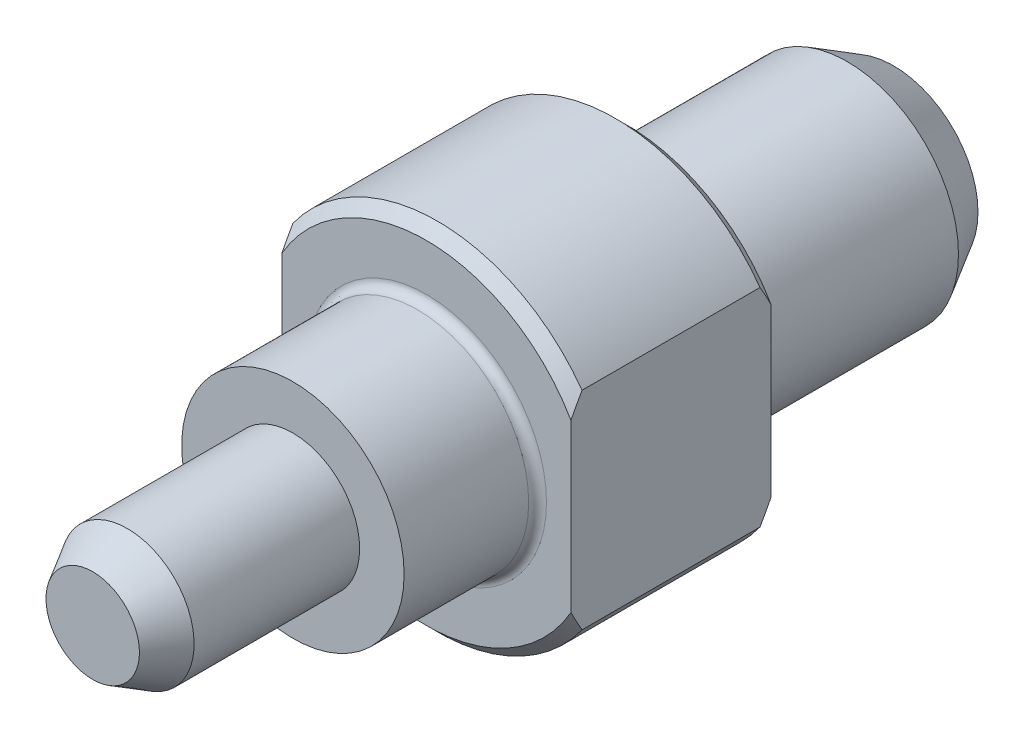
ISO-10303-21;
HEADER;
FILE_DESCRIPTION(('STEP AP214'),'2;1');
FILE_NAME('part.step','',(''),(''),'','','');
FILE_SCHEMA(('AUTOMOTIVE_DESIGN { 1 0 10303 214 1 1 1 1 }'));
ENDSEC;
DATA;
#1=APPLICATION_CONTEXT('core data for automotive mechanical design processes');
#2=APPLICATION_PROTOCOL_DEFINITION('international standard','automotive_design',2000,#1);
#3=PRODUCT_CONTEXT('',#1,'mechanical');
#4=PRODUCT('Part','Part','',(#3));
#5=PRODUCT_RELATED_PRODUCT_CATEGORY('part','',(#4));
#6=PRODUCT_DEFINITION_FORMATION('','',#4);
#7=PRODUCT_DEFINITION_CONTEXT('part definition',#1,'design');
#8=PRODUCT_DEFINITION('design','',#6,#7);
#9=PRODUCT_DEFINITION_SHAPE('','',#8);
#10=(LENGTH_UNIT() NAMED_UNIT(*) SI_UNIT(.MILLI.,.METRE.));
#11=(NAMED_UNIT(*) PLANE_ANGLE_UNIT() SI_UNIT($,.RADIAN.));
#12=(NAMED_UNIT(*) SI_UNIT($,.STERADIAN.) SOLID_ANGLE_UNIT());
#13=UNCERTAINTY_MEASURE_WITH_UNIT(LENGTH_MEASURE(1.E-05),#10,'distance_accuracy_value','');
#14=(GEOMETRIC_REPRESENTATION_CONTEXT(3) GLOBAL_UNCERTAINTY_ASSIGNED_CONTEXT((#13)) GLOBAL_UNIT_ASSIGNED_CONTEXT((#10,
#11,#12)) REPRESENTATION_CONTEXT('',''));
#15=CARTESIAN_POINT('',(0.,0.,0.));
#16=DIRECTION('',(0.,0.,1.));
#17=DIRECTION('',(1.,0.,0.));
#18=AXIS2_PLACEMENT_3D('',#15,#16,#17);
#19=CARTESIAN_POINT('',(0.,0.,24.));
#20=DIRECTION('',(0.,0.,-1.));
#21=DIRECTION('',(-1.,0.,0.));
#22=AXIS2_PLACEMENT_3D('',#19,#20,#21);
#23=CYLINDRICAL_SURFACE('',#22,3.);
#24=CARTESIAN_POINT('',(0.,0.,15.));
#25=DIRECTION('',(0.,0.,1.));
#26=DIRECTION('',(1.,0.,0.));
#27=AXIS2_PLACEMENT_3D('',#24,#25,#26);
#28=CIRCLE('',#27,3.);
#29=CARTESIAN_POINT('',(3.,0.,15.));
#30=VERTEX_POINT('',#29);
#31=EDGE_CURVE('E111',#30,#30,#28,.T.);
#32=ORIENTED_EDGE('',*,*,#31,.T.);
#33=EDGE_LOOP('',(#32));
#34=FACE_BOUND('',#33,.T.);
#35=CARTESIAN_POINT('',(0.,0.,22.441154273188));
#36=DIRECTION('',(0.,0.,-1.));
#37=DIRECTION('',(-1.,0.,0.));
#38=AXIS2_PLACEMENT_3D('',#35,#36,#37);
#39=CIRCLE('',#38,3.);
#40=CARTESIAN_POINT('',(-3.,0.,22.441154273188));
#41=VERTEX_POINT('',#40);
#42=EDGE_CURVE('E260',#41,#41,#39,.F.);
#43=ORIENTED_EDGE('',*,*,#42,.F.);
#44=EDGE_LOOP('',(#43));
#45=FACE_BOUND('',#44,.T.);
#46=ADVANCED_FACE('F14',(#34,#45),#23,.T.);
#47=CARTESIAN_POINT('',(0.,0.,0.));
#48=DIRECTION('',(0.,0.,-1.));
#49=DIRECTION('',(-1.,0.,0.));
#50=AXIS2_PLACEMENT_3D('',#47,#48,#49);
#51=CYLINDRICAL_SURFACE('',#50,5.);
#52=CARTESIAN_POINT('',(0.,0.,-0.4));
#53=DIRECTION('',(0.,0.,1.));
#54=DIRECTION('',(1.,0.,0.));
#55=AXIS2_PLACEMENT_3D('',#52,#53,#54);
#56=CIRCLE('',#55,5.);
#57=CARTESIAN_POINT('',(5.,0.,-0.4));
#58=VERTEX_POINT('',#57);
#59=EDGE_CURVE('E194',#58,#58,#56,.F.);
#60=ORIENTED_EDGE('',*,*,#59,.T.);
#61=EDGE_LOOP('',(#60));
#62=FACE_BOUND('',#61,.T.);
#63=CARTESIAN_POINT('',(0.,0.,-9.92153903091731));
#64=DIRECTION('',(0.,0.,1.));
#65=DIRECTION('',(1.,0.,0.));
#66=AXIS2_PLACEMENT_3D('',#63,#64,#65);
#67=CIRCLE('',#66,5.);
#68=CARTESIAN_POINT('',(5.,0.,-9.92153903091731));
#69=VERTEX_POINT('',#68);
#70=EDGE_CURVE('E255',#69,#69,#67,.T.);
#71=ORIENTED_EDGE('',*,*,#70,.T.);
#72=EDGE_LOOP('',(#71));
#73=FACE_BOUND('',#72,.T.);
#74=ADVANCED_FACE('F216',(#62,#73),#51,.T.);
#75=CARTESIAN_POINT('',(0.,0.,0.));
#76=DIRECTION('',(0.,0.,1.));
#77=DIRECTION('',(1.,0.,0.));
#78=AXIS2_PLACEMENT_3D('',#75,#76,#77);
#79=PLANE('',#78);
#80=CARTESIAN_POINT('',(0.,0.,0.));
#81=DIRECTION('',(0.,0.,1.));
#82=DIRECTION('',(1.,0.,0.));
#83=AXIS2_PLACEMENT_3D('',#80,#81,#82);
#84=CIRCLE('',#83,5.4);
#85=CARTESIAN_POINT('',(5.4,0.,0.));
#86=VERTEX_POINT('',#85);
#87=EDGE_CURVE('E191',#86,#86,#84,.T.);
#88=ORIENTED_EDGE('',*,*,#87,.T.);
#89=EDGE_LOOP('',(#88));
#90=FACE_BOUND('',#89,.T.);
#91=DIRECTION('',(0.,-1.,0.));
#92=VECTOR('',#91,1.);
#93=CARTESIAN_POINT('',(6.5,0.,0.));
#94=LINE('',#93,#92);
#95=CARTESIAN_POINT('',(6.5,3.74165738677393,0.));
#96=VERTEX_POINT('',#95);
#97=CARTESIAN_POINT('',(6.5,-3.74165738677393,0.));
#98=VERTEX_POINT('',#97);
#99=EDGE_CURVE('E274',#96,#98,#94,.T.);
#100=ORIENTED_EDGE('',*,*,#99,.T.);
#101=CARTESIAN_POINT('',(0.,0.,0.));
#102=DIRECTION('',(0.,0.,1.));
#103=DIRECTION('',(1.,0.,0.));
#104=AXIS2_PLACEMENT_3D('',#101,#102,#103);
#105=CIRCLE('',#104,7.5);
#106=CARTESIAN_POINT('',(-6.5,-3.74165738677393,0.));
#107=VERTEX_POINT('',#106);
#108=EDGE_CURVE('E284',#98,#107,#105,.F.);
#109=ORIENTED_EDGE('',*,*,#108,.T.);
#110=DIRECTION('',(0.,-1.,0.));
#111=VECTOR('',#110,1.);
#112=CARTESIAN_POINT('',(-6.5,0.,0.));
#113=LINE('',#112,#111);
#114=CARTESIAN_POINT('',(-6.5,3.74165738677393,0.));
#115=VERTEX_POINT('',#114);
#116=EDGE_CURVE('E87',#115,#107,#113,.T.);
#117=ORIENTED_EDGE('',*,*,#116,.F.);
#118=CARTESIAN_POINT('',(0.,0.,0.));
#119=DIRECTION('',(0.,0.,1.));
#120=DIRECTION('',(1.,0.,0.));
#121=AXIS2_PLACEMENT_3D('',#118,#119,#120);
#122=CIRCLE('',#121,7.5);
#123=EDGE_CURVE('E285',#115,#96,#122,.F.);
#124=ORIENTED_EDGE('',*,*,#123,.T.);
#125=EDGE_LOOP('',(#100,#109,#117,#124));
#126=FACE_BOUND('',#125,.T.);
#127=ADVANCED_FACE('F222',(#90,#126),#79,.F.);
#128=CARTESIAN_POINT('',(0.,0.,9.));
#129=DIRECTION('',(0.,0.,-1.));
#130=DIRECTION('',(-1.,0.,0.));
#131=AXIS2_PLACEMENT_3D('',#128,#129,#130);
#132=CYLINDRICAL_SURFACE('',#131,8.);
#133=DIRECTION('',(0.,0.,1.));
#134=VECTOR('',#133,1.);
#135=CARTESIAN_POINT('',(6.5,4.66368952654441,-12.));
#136=LINE('',#135,#134);
#137=CARTESIAN_POINT('',(6.5,4.66368952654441,0.5));
#138=VERTEX_POINT('',#137);
#139=CARTESIAN_POINT('',(6.5,4.66368952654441,8.5));
#140=VERTEX_POINT('',#139);
#141=EDGE_CURVE('E269',#138,#140,#136,.T.);
#142=ORIENTED_EDGE('',*,*,#141,.F.);
#143=CARTESIAN_POINT('',(0.,0.,0.5));
#144=DIRECTION('',(0.,0.,1.));
#145=DIRECTION('',(1.,0.,0.));
#146=AXIS2_PLACEMENT_3D('',#143,#144,#145);
#147=CIRCLE('',#146,8.);
#148=CARTESIAN_POINT('',(-6.5,4.66368952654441,0.5));
#149=VERTEX_POINT('',#148);
#150=EDGE_CURVE('E189',#138,#149,#147,.T.);
#151=ORIENTED_EDGE('',*,*,#150,.T.);
#152=DIRECTION('',(0.,0.,1.));
#153=VECTOR('',#152,1.);
#154=CARTESIAN_POINT('',(-6.5,4.66368952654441,-12.));
#155=LINE('',#154,#153);
#156=CARTESIAN_POINT('',(-6.5,4.66368952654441,8.5));
#157=VERTEX_POINT('',#156);
#158=EDGE_CURVE('E102',#149,#157,#155,.T.);
#159=ORIENTED_EDGE('',*,*,#158,.T.);
#160=CARTESIAN_POINT('',(0.,0.,8.5));
#161=DIRECTION('',(0.,0.,1.));
#162=DIRECTION('',(1.,0.,0.));
#163=AXIS2_PLACEMENT_3D('',#160,#161,#162);
#164=CIRCLE('',#163,8.);
#165=EDGE_CURVE('E187',#157,#140,#164,.F.);
#166=ORIENTED_EDGE('',*,*,#165,.T.);
#167=EDGE_LOOP('',(#142,#151,#159,#166));
#168=FACE_BOUND('',#167,.T.);
#169=ADVANCED_FACE('F235',(#168),#132,.T.);
#170=DIRECTION('',(0.,0.,1.));
#171=VECTOR('',#170,1.);
#172=CARTESIAN_POINT('',(-6.5,-4.6636895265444,-12.));
#173=LINE('',#172,#171);
#174=CARTESIAN_POINT('',(-6.5,-4.6636895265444,0.5));
#175=VERTEX_POINT('',#174);
#176=CARTESIAN_POINT('',(-6.5,-4.6636895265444,8.5));
#177=VERTEX_POINT('',#176);
#178=EDGE_CURVE('E84',#175,#177,#173,.T.);
#179=ORIENTED_EDGE('',*,*,#178,.F.);
#180=CARTESIAN_POINT('',(0.,0.,0.5));
#181=DIRECTION('',(0.,0.,1.));
#182=DIRECTION('',(1.,0.,0.));
#183=AXIS2_PLACEMENT_3D('',#180,#181,#182);
#184=CIRCLE('',#183,8.);
#185=CARTESIAN_POINT('',(6.5,-4.66368952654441,0.5));
#186=VERTEX_POINT('',#185);
#187=EDGE_CURVE('E98',#175,#186,#184,.T.);
#188=ORIENTED_EDGE('',*,*,#187,.T.);
#189=DIRECTION('',(0.,0.,1.));
#190=VECTOR('',#189,1.);
#191=CARTESIAN_POINT('',(6.5,-4.66368952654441,-12.));
#192=LINE('',#191,#190);
#193=CARTESIAN_POINT('',(6.5,-4.66368952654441,8.5));
#194=VERTEX_POINT('',#193);
#195=EDGE_CURVE('E272',#186,#194,#192,.T.);
#196=ORIENTED_EDGE('',*,*,#195,.T.);
#197=CARTESIAN_POINT('',(0.,0.,8.5));
#198=DIRECTION('',(0.,0.,1.));
#199=DIRECTION('',(1.,0.,0.));
#200=AXIS2_PLACEMENT_3D('',#197,#198,#199);
#201=CIRCLE('',#200,8.);
#202=EDGE_CURVE('E101',#194,#177,#201,.F.);
#203=ORIENTED_EDGE('',*,*,#202,.T.);
#204=EDGE_LOOP('',(#179,#188,#196,#203));
#205=FACE_BOUND('',#204,.T.);
#206=ADVANCED_FACE('F96',(#205),#132,.T.);
#207=CARTESIAN_POINT('',(0.,0.,9.));
#208=DIRECTION('',(0.,0.,1.));
#209=DIRECTION('',(1.,0.,0.));
#210=AXIS2_PLACEMENT_3D('',#207,#208,#209);
#211=PLANE('',#210);
#212=CARTESIAN_POINT('',(0.,0.,9.));
#213=DIRECTION('',(0.,0.,1.));
#214=DIRECTION('',(1.,0.,0.));
#215=AXIS2_PLACEMENT_3D('',#212,#213,#214);
#216=CIRCLE('',#215,5.4);
#217=CARTESIAN_POINT('',(5.4,0.,9.));
#218=VERTEX_POINT('',#217);
#219=EDGE_CURVE('E9',#218,#218,#216,.F.);
#220=ORIENTED_EDGE('',*,*,#219,.T.);
#221=EDGE_LOOP('',(#220));
#222=FACE_BOUND('',#221,.T.);
#223=DIRECTION('',(0.,-1.,0.));
#224=VECTOR('',#223,1.);
#225=CARTESIAN_POINT('',(-6.5,4.66368952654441,9.));
#226=LINE('',#225,#224);
#227=CARTESIAN_POINT('',(-6.5,3.74165738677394,9.));
#228=VERTEX_POINT('',#227);
#229=CARTESIAN_POINT('',(-6.5,-3.74165738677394,9.));
#230=VERTEX_POINT('',#229);
#231=EDGE_CURVE('E103',#228,#230,#226,.T.);
#232=ORIENTED_EDGE('',*,*,#231,.T.);
#233=CARTESIAN_POINT('',(0.,0.,9.));
#234=DIRECTION('',(0.,0.,1.));
#235=DIRECTION('',(1.,0.,0.));
#236=AXIS2_PLACEMENT_3D('',#233,#234,#235);
#237=CIRCLE('',#236,7.5);
#238=CARTESIAN_POINT('',(6.5,-3.74165738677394,9.));
#239=VERTEX_POINT('',#238);
#240=EDGE_CURVE('E184',#230,#239,#237,.T.);
#241=ORIENTED_EDGE('',*,*,#240,.T.);
#242=DIRECTION('',(0.,-1.,0.));
#243=VECTOR('',#242,1.);
#244=CARTESIAN_POINT('',(6.5,4.66368952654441,9.));
#245=LINE('',#244,#243);
#246=CARTESIAN_POINT('',(6.5,3.74165738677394,9.));
#247=VERTEX_POINT('',#246);
#248=EDGE_CURVE('E266',#247,#239,#245,.T.);
#249=ORIENTED_EDGE('',*,*,#248,.F.);
#250=CARTESIAN_POINT('',(0.,0.,9.));
#251=DIRECTION('',(0.,0.,1.));
#252=DIRECTION('',(1.,0.,0.));
#253=AXIS2_PLACEMENT_3D('',#250,#251,#252);
#254=CIRCLE('',#253,7.5);
#255=EDGE_CURVE('E91',#247,#228,#254,.T.);
#256=ORIENTED_EDGE('',*,*,#255,.T.);
#257=EDGE_LOOP('',(#232,#241,#249,#256));
#258=FACE_BOUND('',#257,.T.);
#259=ADVANCED_FACE('F230',(#222,#258),#211,.T.);
#260=CARTESIAN_POINT('',(0.,0.,15.));
#261=DIRECTION('',(0.,0.,-1.));
#262=DIRECTION('',(-1.,0.,0.));
#263=AXIS2_PLACEMENT_3D('',#260,#261,#262);
#264=CYLINDRICAL_SURFACE('',#263,5.);
#265=CARTESIAN_POINT('',(0.,0.,9.4));
#266=DIRECTION('',(0.,0.,1.));
#267=DIRECTION('',(1.,0.,0.));
#268=AXIS2_PLACEMENT_3D('',#265,#266,#267);
#269=CIRCLE('',#268,5.);
#270=CARTESIAN_POINT('',(5.,0.,9.4));
#271=VERTEX_POINT('',#270);
#272=EDGE_CURVE('E22',#271,#271,#269,.T.);
#273=ORIENTED_EDGE('',*,*,#272,.T.);
#274=EDGE_LOOP('',(#273));
#275=FACE_BOUND('',#274,.T.);
#276=CARTESIAN_POINT('',(0.,0.,15.));
#277=DIRECTION('',(0.,0.,1.));
#278=DIRECTION('',(1.,0.,0.));
#279=AXIS2_PLACEMENT_3D('',#276,#277,#278);
#280=CIRCLE('',#279,5.);
#281=CARTESIAN_POINT('',(5.,0.,15.));
#282=VERTEX_POINT('',#281);
#283=EDGE_CURVE('E277',#282,#282,#280,.T.);
#284=ORIENTED_EDGE('',*,*,#283,.F.);
#285=EDGE_LOOP('',(#284));
#286=FACE_BOUND('',#285,.T.);
#287=ADVANCED_FACE('F136',(#275,#286),#264,.T.);
#288=CARTESIAN_POINT('',(0.,0.,15.));
#289=DIRECTION('',(0.,0.,1.));
#290=DIRECTION('',(1.,0.,0.));
#291=AXIS2_PLACEMENT_3D('',#288,#289,#290);
#292=PLANE('',#291);
#293=ORIENTED_EDGE('',*,*,#31,.F.);
#294=EDGE_LOOP('',(#293));
#295=FACE_BOUND('',#294,.T.);
#296=ORIENTED_EDGE('',*,*,#283,.T.);
#297=EDGE_LOOP('',(#296));
#298=FACE_BOUND('',#297,.T.);
#299=ADVANCED_FACE('F134',(#295,#298),#292,.T.);
#300=CARTESIAN_POINT('',(6.5,4.66368952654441,-12.));
#301=DIRECTION('',(-1.,0.,0.));
#302=DIRECTION('',(0.,-1.,0.));
#303=AXIS2_PLACEMENT_3D('',#300,#301,#302);
#304=PLANE('',#303);
#305=ORIENTED_EDGE('',*,*,#195,.F.);
#306=CARTESIAN_POINT('',(6.5,-4.66368952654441,0.5));
#307=CARTESIAN_POINT('',(6.5,-4.58815546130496,0.455968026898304));
#308=CARTESIAN_POINT('',(6.5,-4.51231410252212,0.412460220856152));
#309=CARTESIAN_POINT('',(6.5,-4.36000596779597,0.326601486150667));
#310=CARTESIAN_POINT('',(6.5,-4.28353936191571,0.284250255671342));
#311=CARTESIAN_POINT('',(6.5,-4.12992806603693,0.200788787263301));
#312=CARTESIAN_POINT('',(6.5,-4.05278335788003,0.159678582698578));
#313=CARTESIAN_POINT('',(6.5,-3.89776768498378,0.0788010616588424));
#314=CARTESIAN_POINT('',(6.5,-3.81989653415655,0.0390341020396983));
#315=CARTESIAN_POINT('',(6.5,-3.74165738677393,0.));
#316=B_SPLINE_CURVE_WITH_KNOTS('',3,(#306,#307,#308,#309,#310,#311,#312,#313,#314,#315),
.UNSPECIFIED.,.F.,.F.,(4,2,2,2,4),(0.,0.262293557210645,0.524518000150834,0.786749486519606,
1.04905009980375),.UNSPECIFIED.);
#317=EDGE_CURVE('E106',#186,#98,#316,.T.);
#318=ORIENTED_EDGE('',*,*,#317,.T.);
#319=ORIENTED_EDGE('',*,*,#99,.F.);
#320=CARTESIAN_POINT('',(6.5,3.74165738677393,0.));
#321=CARTESIAN_POINT('',(6.5,3.81989653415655,0.0390341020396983));
#322=CARTESIAN_POINT('',(6.5,3.89776768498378,0.0788010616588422));
#323=CARTESIAN_POINT('',(6.5,4.05278335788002,0.159678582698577));
#324=CARTESIAN_POINT('',(6.5,4.12992806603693,0.200788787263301));
#325=CARTESIAN_POINT('',(6.5,4.28353936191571,0.284250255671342));
#326=CARTESIAN_POINT('',(6.5,4.36000596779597,0.326601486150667));
#327=CARTESIAN_POINT('',(6.5,4.51231410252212,0.412460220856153));
#328=CARTESIAN_POINT('',(6.5,4.58815546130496,0.455968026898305));
#329=CARTESIAN_POINT('',(6.5,4.66368952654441,0.5));
#330=B_SPLINE_CURVE_WITH_KNOTS('',3,(#320,#321,#322,#323,#324,#325,#326,#327,#328,#329),
.UNSPECIFIED.,.F.,.F.,(4,2,2,2,4),(0.,0.262300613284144,0.524532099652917,0.786756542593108,
1.04905009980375),.UNSPECIFIED.);
#331=EDGE_CURVE('E109',#96,#138,#330,.T.);
#332=ORIENTED_EDGE('',*,*,#331,.T.);
#333=ORIENTED_EDGE('',*,*,#141,.T.);
#334=CARTESIAN_POINT('',(6.5,4.66368952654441,8.5));
#335=CARTESIAN_POINT('',(6.5,4.58815546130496,8.5440319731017));
#336=CARTESIAN_POINT('',(6.5,4.51231410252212,8.58753977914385));
#337=CARTESIAN_POINT('',(6.5,4.36000596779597,8.67339851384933));
#338=CARTESIAN_POINT('',(6.5,4.28353936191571,8.71574974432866));
#339=CARTESIAN_POINT('',(6.5,4.12992806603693,8.7992112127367));
#340=CARTESIAN_POINT('',(6.5,4.05278335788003,8.84032141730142));
#341=CARTESIAN_POINT('',(6.5,3.89776768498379,8.92119893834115));
#342=CARTESIAN_POINT('',(6.5,3.81989653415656,8.9609658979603));
#343=CARTESIAN_POINT('',(6.5,3.74165738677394,9.));
#344=B_SPLINE_CURVE_WITH_KNOTS('',3,(#334,#335,#336,#337,#338,#339,#340,#341,#342,#343),
.UNSPECIFIED.,.F.,.F.,(4,2,2,2,4),(0.,0.262293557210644,0.524518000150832,0.786749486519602,
1.04905009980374),.UNSPECIFIED.);
#345=EDGE_CURVE('E107',#140,#247,#344,.T.);
#346=ORIENTED_EDGE('',*,*,#345,.T.);
#347=ORIENTED_EDGE('',*,*,#248,.T.);
#348=CARTESIAN_POINT('',(6.5,-3.74165738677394,9.));
#349=CARTESIAN_POINT('',(6.5,-3.81989653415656,8.9609658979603));
#350=CARTESIAN_POINT('',(6.5,-3.89776768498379,8.92119893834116));
#351=CARTESIAN_POINT('',(6.5,-4.05278335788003,8.84032141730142));
#352=CARTESIAN_POINT('',(6.5,-4.12992806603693,8.7992112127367));
#353=CARTESIAN_POINT('',(6.5,-4.28353936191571,8.71574974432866));
#354=CARTESIAN_POINT('',(6.5,-4.36000596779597,8.67339851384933));
#355=CARTESIAN_POINT('',(6.5,-4.51231410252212,8.58753977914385));
#356=CARTESIAN_POINT('',(6.5,-4.58815546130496,8.5440319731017));
#357=CARTESIAN_POINT('',(6.5,-4.66368952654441,8.5));
#358=B_SPLINE_CURVE_WITH_KNOTS('',3,(#348,#349,#350,#351,#352,#353,#354,#355,#356,#357),
.UNSPECIFIED.,.F.,.F.,(4,2,2,2,4),(0.,0.262300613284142,0.524532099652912,0.786756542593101,
1.04905009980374),.UNSPECIFIED.);
#359=EDGE_CURVE('E145',#239,#194,#358,.T.);
#360=ORIENTED_EDGE('',*,*,#359,.T.);
#361=EDGE_LOOP('',(#305,#318,#319,#332,#333,#346,#347,#360));
#362=FACE_BOUND('',#361,.T.);
#363=ADVANCED_FACE('F129',(#362),#304,.F.);
#364=CARTESIAN_POINT('',(-6.5,4.66368952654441,-12.));
#365=DIRECTION('',(-1.,0.,0.));
#366=DIRECTION('',(0.,0.,1.));
#367=AXIS2_PLACEMENT_3D('',#364,#365,#366);
#368=PLANE('',#367);
#369=ORIENTED_EDGE('',*,*,#116,.T.);
#370=CARTESIAN_POINT('',(-6.5,-3.74165738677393,0.));
#371=CARTESIAN_POINT('',(-6.5,-3.81989653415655,0.0390341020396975));
#372=CARTESIAN_POINT('',(-6.5,-3.89776768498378,0.0788010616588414));
#373=CARTESIAN_POINT('',(-6.5,-4.05278335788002,0.159678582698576));
#374=CARTESIAN_POINT('',(-6.5,-4.12992806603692,0.200788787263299));
#375=CARTESIAN_POINT('',(-6.5,-4.2835393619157,0.28425025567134));
#376=CARTESIAN_POINT('',(-6.5,-4.36000596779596,0.326601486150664));
#377=CARTESIAN_POINT('',(-6.5,-4.51231410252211,0.41246022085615));
#378=CARTESIAN_POINT('',(-6.5,-4.58815546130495,0.455968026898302));
#379=CARTESIAN_POINT('',(-6.5,-4.6636895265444,0.5));
#380=B_SPLINE_CURVE_WITH_KNOTS('',3,(#370,#371,#372,#373,#374,#375,#376,#377,#378,#379),
.UNSPECIFIED.,.F.,.F.,(4,2,2,2,4),(0.,0.262300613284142,0.524532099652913,0.786756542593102,
1.04905009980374),.UNSPECIFIED.);
#381=EDGE_CURVE('E81',#107,#175,#380,.T.);
#382=ORIENTED_EDGE('',*,*,#381,.T.);
#383=ORIENTED_EDGE('',*,*,#178,.T.);
#384=CARTESIAN_POINT('',(-6.5,-4.6636895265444,8.5));
#385=CARTESIAN_POINT('',(-6.5,-4.58815546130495,8.5440319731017));
#386=CARTESIAN_POINT('',(-6.5,-4.51231410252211,8.58753977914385));
#387=CARTESIAN_POINT('',(-6.5,-4.36000596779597,8.67339851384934));
#388=CARTESIAN_POINT('',(-6.5,-4.28353936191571,8.71574974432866));
#389=CARTESIAN_POINT('',(-6.5,-4.12992806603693,8.7992112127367));
#390=CARTESIAN_POINT('',(-6.5,-4.05278335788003,8.84032141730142));
#391=CARTESIAN_POINT('',(-6.5,-3.89776768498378,8.92119893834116));
#392=CARTESIAN_POINT('',(-6.5,-3.81989653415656,8.9609658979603));
#393=CARTESIAN_POINT('',(-6.5,-3.74165738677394,9.));
#394=B_SPLINE_CURVE_WITH_KNOTS('',3,(#384,#385,#386,#387,#388,#389,#390,#391,#392,#393),
.UNSPECIFIED.,.F.,.F.,(4,2,2,2,4),(0.,0.26229355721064,0.524518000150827,0.786749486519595,
1.04905009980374),.UNSPECIFIED.);
#395=EDGE_CURVE('E92',#177,#230,#394,.T.);
#396=ORIENTED_EDGE('',*,*,#395,.T.);
#397=ORIENTED_EDGE('',*,*,#231,.F.);
#398=CARTESIAN_POINT('',(-6.5,3.74165738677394,9.));
#399=CARTESIAN_POINT('',(-6.5,3.81989653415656,8.9609658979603));
#400=CARTESIAN_POINT('',(-6.5,3.89776768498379,8.92119893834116));
#401=CARTESIAN_POINT('',(-6.5,4.05278335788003,8.84032141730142));
#402=CARTESIAN_POINT('',(-6.5,4.12992806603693,8.7992112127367));
#403=CARTESIAN_POINT('',(-6.5,4.28353936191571,8.71574974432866));
#404=CARTESIAN_POINT('',(-6.5,4.36000596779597,8.67339851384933));
#405=CARTESIAN_POINT('',(-6.5,4.51231410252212,8.58753977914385));
#406=CARTESIAN_POINT('',(-6.5,4.58815546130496,8.5440319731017));
#407=CARTESIAN_POINT('',(-6.5,4.66368952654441,8.5));
#408=B_SPLINE_CURVE_WITH_KNOTS('',3,(#398,#399,#400,#401,#402,#403,#404,#405,#406,#407),
.UNSPECIFIED.,.F.,.F.,(4,2,2,2,4),(0.,0.262300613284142,0.524532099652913,0.7867565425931,
1.04905009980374),.UNSPECIFIED.);
#409=EDGE_CURVE('E29',#228,#157,#408,.T.);
#410=ORIENTED_EDGE('',*,*,#409,.T.);
#411=ORIENTED_EDGE('',*,*,#158,.F.);
#412=CARTESIAN_POINT('',(-6.5,4.66368952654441,0.5));
#413=CARTESIAN_POINT('',(-6.5,4.58815546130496,0.455968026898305));
#414=CARTESIAN_POINT('',(-6.5,4.51231410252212,0.412460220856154));
#415=CARTESIAN_POINT('',(-6.5,4.36000596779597,0.326601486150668));
#416=CARTESIAN_POINT('',(-6.5,4.28353936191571,0.284250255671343));
#417=CARTESIAN_POINT('',(-6.5,4.12992806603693,0.200788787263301));
#418=CARTESIAN_POINT('',(-6.5,4.05278335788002,0.159678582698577));
#419=CARTESIAN_POINT('',(-6.5,3.89776768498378,0.0788010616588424));
#420=CARTESIAN_POINT('',(-6.5,3.81989653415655,0.0390341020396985));
#421=CARTESIAN_POINT('',(-6.5,3.74165738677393,0.));
#422=B_SPLINE_CURVE_WITH_KNOTS('',3,(#412,#413,#414,#415,#416,#417,#418,#419,#420,#421),
.UNSPECIFIED.,.F.,.F.,(4,2,2,2,4),(0.,0.262293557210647,0.524518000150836,0.78674948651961,
1.04905009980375),.UNSPECIFIED.);
#423=EDGE_CURVE('E37',#149,#115,#422,.T.);
#424=ORIENTED_EDGE('',*,*,#423,.T.);
#425=EDGE_LOOP('',(#369,#382,#383,#396,#397,#410,#411,#424));
#426=FACE_BOUND('',#425,.T.);
#427=ADVANCED_FACE('F83',(#426),#368,.T.);
#428=CARTESIAN_POINT('',(0.,0.,0.5));
#429=DIRECTION('',(0.,0.,1.));
#430=DIRECTION('',(1.,0.,0.));
#431=AXIS2_PLACEMENT_3D('',#428,#429,#430);
#432=CONICAL_SURFACE('',#431,8.,0.78539816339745);
#433=ORIENTED_EDGE('',*,*,#381,.F.);
#434=ORIENTED_EDGE('',*,*,#108,.F.);
#435=ORIENTED_EDGE('',*,*,#317,.F.);
#436=ORIENTED_EDGE('',*,*,#187,.F.);
#437=EDGE_LOOP('',(#433,#434,#435,#436));
#438=FACE_BOUND('',#437,.T.);
#439=ADVANCED_FACE('F105',(#438),#432,.T.);
#440=CARTESIAN_POINT('',(0.,0.,9.));
#441=DIRECTION('',(0.,0.,-1.));
#442=DIRECTION('',(-1.,0.,0.));
#443=AXIS2_PLACEMENT_3D('',#440,#441,#442);
#444=CONICAL_SURFACE('',#443,7.5,0.785398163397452);
#445=ORIENTED_EDGE('',*,*,#395,.F.);
#446=ORIENTED_EDGE('',*,*,#202,.F.);
#447=ORIENTED_EDGE('',*,*,#359,.F.);
#448=ORIENTED_EDGE('',*,*,#240,.F.);
#449=EDGE_LOOP('',(#445,#446,#447,#448));
#450=FACE_BOUND('',#449,.T.);
#451=ADVANCED_FACE('F157',(#450),#444,.T.);
#452=CARTESIAN_POINT('',(0.,0.,0.5));
#453=DIRECTION('',(0.,0.,1.));
#454=DIRECTION('',(1.,0.,0.));
#455=AXIS2_PLACEMENT_3D('',#452,#453,#454);
#456=CONICAL_SURFACE('',#455,8.,0.78539816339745);
#457=ORIENTED_EDGE('',*,*,#331,.F.);
#458=ORIENTED_EDGE('',*,*,#123,.F.);
#459=ORIENTED_EDGE('',*,*,#423,.F.);
#460=ORIENTED_EDGE('',*,*,#150,.F.);
#461=EDGE_LOOP('',(#457,#458,#459,#460));
#462=FACE_BOUND('',#461,.T.);
#463=ADVANCED_FACE('F160',(#462),#456,.T.);
#464=CARTESIAN_POINT('',(0.,0.,9.));
#465=DIRECTION('',(0.,0.,-1.));
#466=DIRECTION('',(-1.,0.,0.));
#467=AXIS2_PLACEMENT_3D('',#464,#465,#466);
#468=CONICAL_SURFACE('',#467,7.5,0.785398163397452);
#469=ORIENTED_EDGE('',*,*,#345,.F.);
#470=ORIENTED_EDGE('',*,*,#165,.F.);
#471=ORIENTED_EDGE('',*,*,#409,.F.);
#472=ORIENTED_EDGE('',*,*,#255,.F.);
#473=EDGE_LOOP('',(#469,#470,#471,#472));
#474=FACE_BOUND('',#473,.T.);
#475=ADVANCED_FACE('F127',(#474),#468,.T.);
#476=CARTESIAN_POINT('',(0.,0.,-0.4));
#477=DIRECTION('',(0.,0.,1.));
#478=DIRECTION('',(1.,0.,0.));
#479=AXIS2_PLACEMENT_3D('',#476,#477,#478);
#480=TOROIDAL_SURFACE('',#479,5.4,0.4);
#481=ORIENTED_EDGE('',*,*,#59,.F.);
#482=EDGE_LOOP('',(#481));
#483=FACE_BOUND('',#482,.T.);
#484=ORIENTED_EDGE('',*,*,#87,.F.);
#485=EDGE_LOOP('',(#484));
#486=FACE_BOUND('',#485,.T.);
#487=ADVANCED_FACE('F203',(#483,#486),#480,.F.);
#488=CARTESIAN_POINT('',(0.,0.,9.4));
#489=DIRECTION('',(0.,0.,1.));
#490=DIRECTION('',(1.,0.,0.));
#491=AXIS2_PLACEMENT_3D('',#488,#489,#490);
#492=TOROIDAL_SURFACE('',#491,5.4,0.4);
#493=ORIENTED_EDGE('',*,*,#219,.F.);
#494=EDGE_LOOP('',(#493));
#495=FACE_BOUND('',#494,.T.);
#496=ORIENTED_EDGE('',*,*,#272,.F.);
#497=EDGE_LOOP('',(#496));
#498=FACE_BOUND('',#497,.T.);
#499=ADVANCED_FACE('F16',(#495,#498),#492,.F.);
#500=CARTESIAN_POINT('',(0.,0.,-9.92153903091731));
#501=DIRECTION('',(0.,0.,1.));
#502=DIRECTION('',(1.,0.,0.));
#503=AXIS2_PLACEMENT_3D('',#500,#501,#502);
#504=CONICAL_SURFACE('',#503,5.,0.523598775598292);
#505=CARTESIAN_POINT('',(0.,0.,-12.));
#506=DIRECTION('',(0.,0.,1.));
#507=DIRECTION('',(1.,0.,0.));
#508=AXIS2_PLACEMENT_3D('',#505,#506,#507);
#509=CIRCLE('',#508,3.8);
#510=CARTESIAN_POINT('',(3.8,0.,-12.));
#511=VERTEX_POINT('',#510);
#512=EDGE_CURVE('E254',#511,#511,#509,.T.);
#513=ORIENTED_EDGE('',*,*,#512,.T.);
#514=EDGE_LOOP('',(#513));
#515=FACE_BOUND('',#514,.T.);
#516=ORIENTED_EDGE('',*,*,#70,.F.);
#517=EDGE_LOOP('',(#516));
#518=FACE_BOUND('',#517,.T.);
#519=ADVANCED_FACE('F202',(#515,#518),#504,.T.);
#520=CARTESIAN_POINT('',(0.,0.,-12.));
#521=DIRECTION('',(0.,0.,1.));
#522=DIRECTION('',(1.,0.,0.));
#523=AXIS2_PLACEMENT_3D('',#520,#521,#522);
#524=PLANE('',#523);
#525=ORIENTED_EDGE('',*,*,#512,.F.);
#526=EDGE_LOOP('',(#525));
#527=FACE_BOUND('',#526,.T.);
#528=ADVANCED_FACE('F211',(#527),#524,.F.);
#529=CARTESIAN_POINT('',(0.,0.,24.));
#530=DIRECTION('',(0.,0.,-1.));
#531=DIRECTION('',(-1.,0.,0.));
#532=AXIS2_PLACEMENT_3D('',#529,#530,#531);
#533=CONICAL_SURFACE('',#532,2.1,0.523598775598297);
#534=CARTESIAN_POINT('',(0.,0.,24.));
#535=DIRECTION('',(0.,0.,1.));
#536=DIRECTION('',(1.,0.,0.));
#537=AXIS2_PLACEMENT_3D('',#534,#535,#536);
#538=CIRCLE('',#537,2.1);
#539=CARTESIAN_POINT('',(2.1,0.,24.));
#540=VERTEX_POINT('',#539);
#541=EDGE_CURVE('E422',#540,#540,#538,.T.);
#542=ORIENTED_EDGE('',*,*,#541,.F.);
#543=EDGE_LOOP('',(#542));
#544=FACE_BOUND('',#543,.T.);
#545=ORIENTED_EDGE('',*,*,#42,.T.);
#546=EDGE_LOOP('',(#545));
#547=FACE_BOUND('',#546,.T.);
#548=ADVANCED_FACE('F244',(#544,#547),#533,.T.);
#549=CARTESIAN_POINT('',(0.,0.,24.));
#550=DIRECTION('',(0.,0.,1.));
#551=DIRECTION('',(1.,0.,0.));
#552=AXIS2_PLACEMENT_3D('',#549,#550,#551);
#553=PLANE('',#552);
#554=ORIENTED_EDGE('',*,*,#541,.T.);
#555=EDGE_LOOP('',(#554));
#556=FACE_BOUND('',#555,.T.);
#557=ADVANCED_FACE('F139',(#556),#553,.T.);
#558=CLOSED_SHELL('',(#46,#74,#127,#169,#206,#259,#287,#299,#363,#427,#439,#451,#463,#475,#487,
#499,#519,#528,#548,#557));
#559=MANIFOLD_SOLID_BREP('B1',#558);
#560=ADVANCED_BREP_SHAPE_REPRESENTATION('',(#18,#559),#14);
#561=SHAPE_DEFINITION_REPRESENTATION(#9,#560);
ENDSEC;
END-ISO-10303-21;
